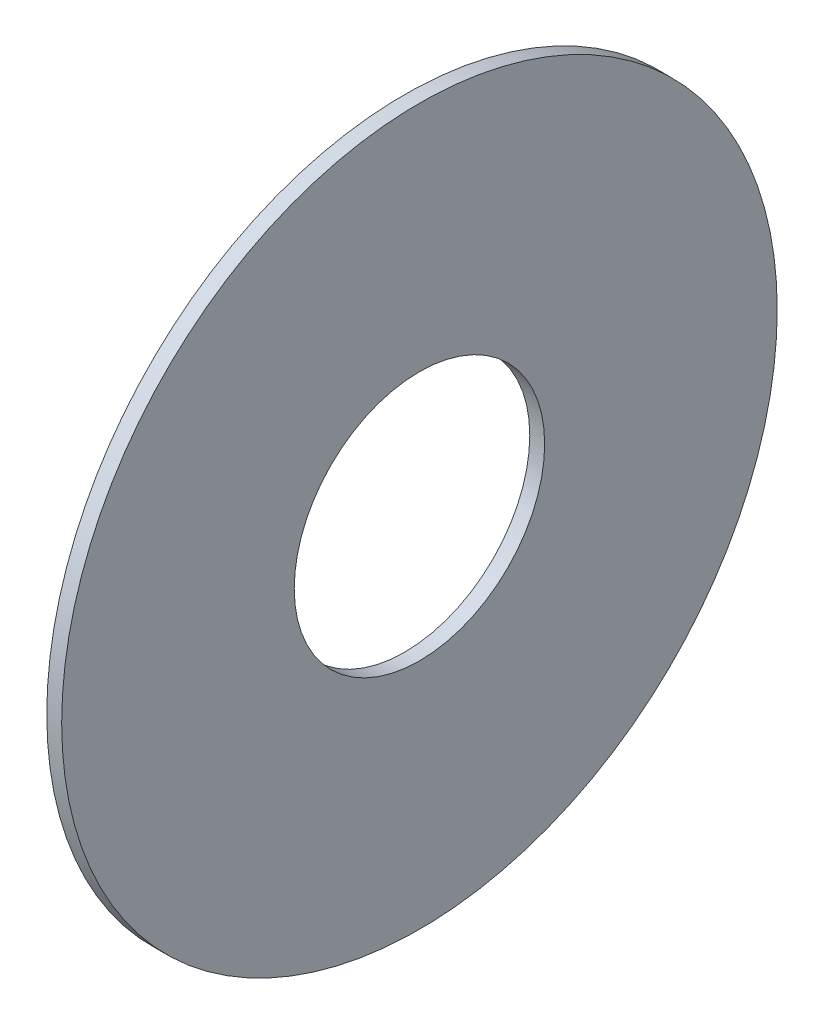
from build123d import *

# Parameters (mm, degrees)
SKETCH1_W = 0.5
SKETCH1_H = 7.8


with BuildPart() as part:
    # Sketch1 → Base-Revolve (revolve)
    with BuildSketch(Plane.XY, mode=Mode.PRIVATE) as base_revolve_sk:
        with Locations((-0.25, 8.1)):
            Rectangle(SKETCH1_W, SKETCH1_H)
    revolve(base_revolve_sk.sketch.rotate(Axis((-34.925, 0, 0), (1, 0, 0)), 90), axis=Axis((-34.925, 0, 0), (1, 0, 0)))


solid = part.part
